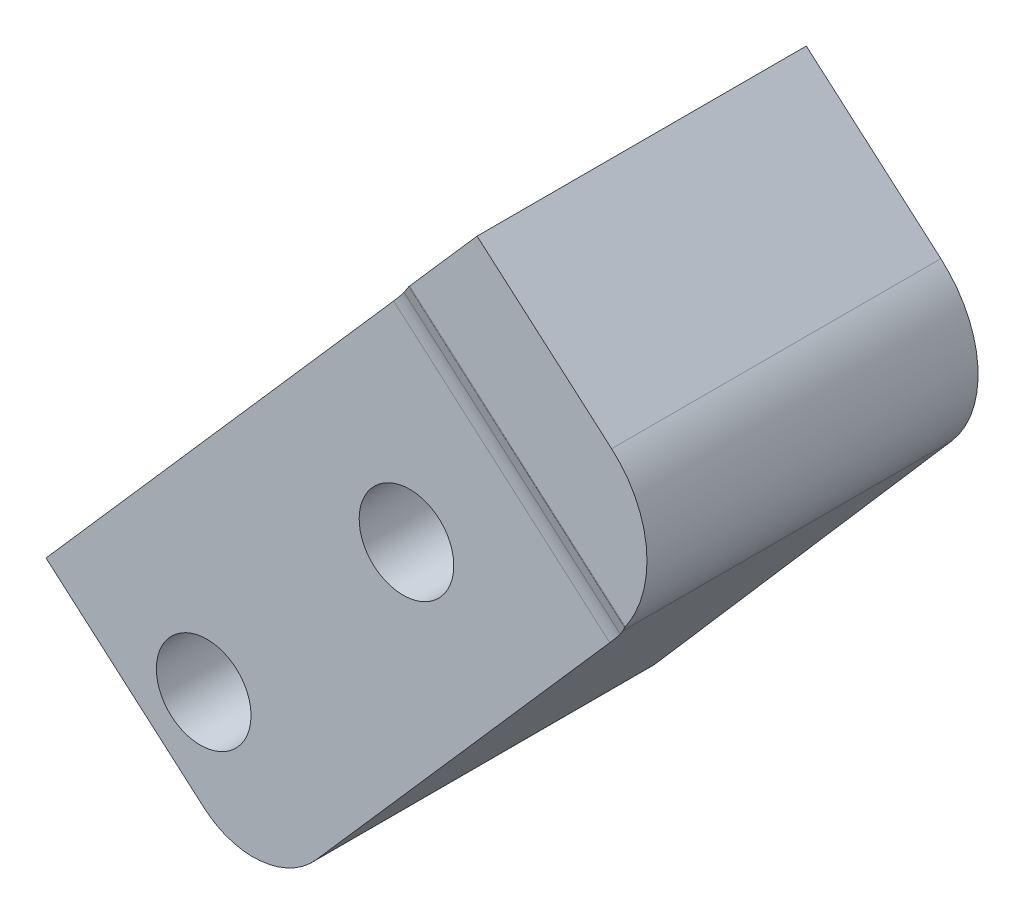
ISO-10303-21;
HEADER;
FILE_DESCRIPTION(('STEP AP214'),'2;1');
FILE_NAME('part.step','',(''),(''),'','','');
FILE_SCHEMA(('AUTOMOTIVE_DESIGN { 1 0 10303 214 1 1 1 1 }'));
ENDSEC;
DATA;
#1=APPLICATION_CONTEXT('core data for automotive mechanical design processes');
#2=APPLICATION_PROTOCOL_DEFINITION('international standard','automotive_design',2000,#1);
#3=PRODUCT_CONTEXT('',#1,'mechanical');
#4=PRODUCT('Part','Part','',(#3));
#5=PRODUCT_RELATED_PRODUCT_CATEGORY('part','',(#4));
#6=PRODUCT_DEFINITION_FORMATION('','',#4);
#7=PRODUCT_DEFINITION_CONTEXT('part definition',#1,'design');
#8=PRODUCT_DEFINITION('design','',#6,#7);
#9=PRODUCT_DEFINITION_SHAPE('','',#8);
#10=(LENGTH_UNIT() NAMED_UNIT(*) SI_UNIT(.MILLI.,.METRE.));
#11=(NAMED_UNIT(*) PLANE_ANGLE_UNIT() SI_UNIT($,.RADIAN.));
#12=(NAMED_UNIT(*) SI_UNIT($,.STERADIAN.) SOLID_ANGLE_UNIT());
#13=UNCERTAINTY_MEASURE_WITH_UNIT(LENGTH_MEASURE(1.E-05),#10,'distance_accuracy_value','');
#14=(GEOMETRIC_REPRESENTATION_CONTEXT(3) GLOBAL_UNCERTAINTY_ASSIGNED_CONTEXT((#13)) GLOBAL_UNIT_ASSIGNED_CONTEXT((#10,
#11,#12)) REPRESENTATION_CONTEXT('',''));
#15=CARTESIAN_POINT('',(0.,0.,0.));
#16=DIRECTION('',(0.,0.,1.));
#17=DIRECTION('',(1.,0.,0.));
#18=AXIS2_PLACEMENT_3D('',#15,#16,#17);
#19=CARTESIAN_POINT('',(-628.695624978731,-74.2116467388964,3.175));
#20=DIRECTION('',(0.,0.,-1.));
#21=DIRECTION('',(-1.,0.,0.));
#22=AXIS2_PLACEMENT_3D('',#19,#20,#21);
#23=CYLINDRICAL_SURFACE('',#22,10.795);
#24=DIRECTION('',(0.,0.,-1.));
#25=VECTOR('',#24,1.);
#26=CARTESIAN_POINT('',(-621.617450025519,-66.0610967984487,3.175));
#27=LINE('',#26,#25);
#28=CARTESIAN_POINT('',(-621.617450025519,-66.0610967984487,1.10115157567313));
#29=VERTEX_POINT('',#28);
#30=CARTESIAN_POINT('',(-621.617450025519,-66.0610967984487,-31.75));
#31=VERTEX_POINT('',#30);
#32=EDGE_CURVE('E247',#29,#31,#27,.T.);
#33=ORIENTED_EDGE('',*,*,#32,.F.);
#34=CARTESIAN_POINT('',(-628.695624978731,-74.2116467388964,1.66689355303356));
#35=DIRECTION('',(-0.0343161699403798,-0.0395152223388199,-0.998629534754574));
#36=DIRECTION('',(0.654791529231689,0.753995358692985,-0.0523359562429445));
#37=AXIS2_PLACEMENT_3D('',#34,#35,#36);
#38=ELLIPSE('',#37,10.8098144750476,10.795);
#39=CARTESIAN_POINT('',(-619.758730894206,-80.2667230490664,1.59938875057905));
#40=VERTEX_POINT('',#39);
#41=EDGE_CURVE('E350',#29,#40,#38,.T.);
#42=ORIENTED_EDGE('',*,*,#41,.T.);
#43=CARTESIAN_POINT('',(-619.758730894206,-80.2667230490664,1.59938875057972));
#44=CARTESIAN_POINT('',(-619.769824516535,-80.283100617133,1.60043942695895));
#45=CARTESIAN_POINT('',(-619.781024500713,-80.2995301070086,1.59977123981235));
#46=CARTESIAN_POINT('',(-619.803062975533,-80.3316733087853,1.59514276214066));
#47=CARTESIAN_POINT('',(-619.813904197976,-80.3473947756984,1.59124925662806));
#48=CARTESIAN_POINT('',(-619.829345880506,-80.3696653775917,1.58331824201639));
#49=CARTESIAN_POINT('',(-619.834128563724,-80.3765453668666,1.58051480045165));
#50=CARTESIAN_POINT('',(-619.843618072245,-80.3901633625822,1.57425024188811));
#51=CARTESIAN_POINT('',(-619.848323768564,-80.3968994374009,1.57078321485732));
#52=CARTESIAN_POINT('',(-619.852955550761,-80.4035141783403,1.56700456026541));
#53=B_SPLINE_CURVE_WITH_KNOTS('',3,(#43,#44,#45,#46,#47,#48,#49,#50,#51,#52),.UNSPECIFIED.,.F.,
.F.,(4,2,2,2,4),(0.,0.0593822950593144,0.117564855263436,0.144049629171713,0.170782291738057),.UNSPECIFIED.);
#54=CARTESIAN_POINT('',(-619.852955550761,-80.4035141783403,1.56700456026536));
#55=VERTEX_POINT('',#54);
#56=EDGE_CURVE('E168',#40,#55,#53,.T.);
#57=ORIENTED_EDGE('',*,*,#56,.T.);
#58=CARTESIAN_POINT('',(-628.695624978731,-74.2116467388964,1.03855862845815));
#59=DIRECTION('',(0.279179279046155,0.321476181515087,-0.90482705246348));
#60=DIRECTION('',(-0.593286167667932,-0.683171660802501,-0.42577929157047));
#61=AXIS2_PLACEMENT_3D('',#58,#59,#60);
#62=ELLIPSE('',#61,11.9304567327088,10.795);
#63=CARTESIAN_POINT('',(-620.545075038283,-81.2898216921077,1.03855862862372));
#64=VERTEX_POINT('',#63);
#65=EDGE_CURVE('E142',#55,#64,#62,.T.);
#66=ORIENTED_EDGE('',*,*,#65,.T.);
#67=DIRECTION('',(0.,0.,-1.));
#68=VECTOR('',#67,1.);
#69=CARTESIAN_POINT('',(-620.545075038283,-81.2898216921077,3.175));
#70=LINE('',#69,#68);
#71=CARTESIAN_POINT('',(-620.545075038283,-81.2898216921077,-31.75));
#72=VERTEX_POINT('',#71);
#73=EDGE_CURVE('E74',#64,#72,#70,.T.);
#74=ORIENTED_EDGE('',*,*,#73,.T.);
#75=CARTESIAN_POINT('',(-628.695624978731,-74.2116467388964,-31.75));
#76=DIRECTION('',(0.,0.,1.));
#77=DIRECTION('',(-1.,0.,0.));
#78=AXIS2_PLACEMENT_3D('',#75,#76,#77);
#79=CIRCLE('',#78,10.795);
#80=EDGE_CURVE('E319',#72,#31,#79,.T.);
#81=ORIENTED_EDGE('',*,*,#80,.T.);
#82=EDGE_LOOP('',(#33,#42,#57,#66,#74,#81));
#83=FACE_BOUND('',#82,.T.);
#84=ADVANCED_FACE('F50',(#83),#23,.T.);
#85=CARTESIAN_POINT('',(-635.041885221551,-54.4029262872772,3.175));
#86=DIRECTION('',(-0.65569012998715,-0.755030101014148,0.));
#87=DIRECTION('',(0.755030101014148,-0.65569012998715,0.));
#88=AXIS2_PLACEMENT_3D('',#85,#86,#87);
#89=PLANE('',#88);
#90=DIRECTION('',(0.,0.,-1.));
#91=VECTOR('',#90,1.);
#92=CARTESIAN_POINT('',(-635.041885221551,-54.4029262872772,3.175));
#93=LINE('',#92,#91);
#94=CARTESIAN_POINT('',(-635.041885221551,-54.4029262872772,1.10115157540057));
#95=VERTEX_POINT('',#94);
#96=CARTESIAN_POINT('',(-635.041885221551,-54.4029262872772,-31.75));
#97=VERTEX_POINT('',#96);
#98=EDGE_CURVE('E241',#95,#97,#93,.T.);
#99=ORIENTED_EDGE('',*,*,#98,.F.);
#100=DIRECTION('',(0.755030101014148,-0.65569012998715,1.53293565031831E-11));
#101=VECTOR('',#100,1.);
#102=CARTESIAN_POINT('',(-635.041885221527,-54.402926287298,1.10115157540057));
#103=LINE('',#102,#101);
#104=EDGE_CURVE('E177',#95,#29,#103,.T.);
#105=ORIENTED_EDGE('',*,*,#104,.T.);
#106=ORIENTED_EDGE('',*,*,#32,.T.);
#107=DIRECTION('',(-0.755030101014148,0.65569012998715,0.));
#108=VECTOR('',#107,1.);
#109=CARTESIAN_POINT('',(-635.041885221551,-54.4029262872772,-31.75));
#110=LINE('',#109,#108);
#111=EDGE_CURVE('E244',#31,#97,#110,.T.);
#112=ORIENTED_EDGE('',*,*,#111,.T.);
#113=EDGE_LOOP('',(#99,#105,#106,#112));
#114=FACE_BOUND('',#113,.T.);
#115=ADVANCED_FACE('F232',(#114),#89,.F.);
#116=CARTESIAN_POINT('',(-635.041885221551,-54.4029262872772,3.175));
#117=DIRECTION('',(0.755030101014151,-0.655690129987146,0.));
#118=DIRECTION('',(0.655690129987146,0.755030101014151,0.));
#119=AXIS2_PLACEMENT_3D('',#116,#117,#118);
#120=PLANE('',#119);
#121=CARTESIAN_POINT('',(-641.287333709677,-61.5945879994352,1.25462379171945));
#122=DIRECTION('',(0.755030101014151,-0.655690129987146,0.));
#123=DIRECTION('',(0.655690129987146,0.755030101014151,0.));
#124=AXIS2_PLACEMENT_3D('',#121,#122,#123);
#125=CIRCLE('',#124,0.345238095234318);
#126=CARTESIAN_POINT('',(-641.383717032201,-61.7055738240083,1.56700455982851));
#127=VERTEX_POINT('',#126);
#128=CARTESIAN_POINT('',(-641.275486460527,-61.5809458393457,1.59938875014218));
#129=VERTEX_POINT('',#128);
#130=EDGE_CURVE('E59',#127,#129,#125,.F.);
#131=ORIENTED_EDGE('',*,*,#130,.T.);
#132=DIRECTION('',(0.65479152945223,0.75399535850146,-0.0523359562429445));
#133=VECTOR('',#132,1.);
#134=CARTESIAN_POINT('',(-635.112954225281,-54.4847625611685,1.10683195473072));
#135=LINE('',#134,#133);
#136=EDGE_CURVE('E12',#129,#95,#135,.T.);
#137=ORIENTED_EDGE('',*,*,#136,.T.);
#138=ORIENTED_EDGE('',*,*,#98,.T.);
#139=DIRECTION('',(-0.655690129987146,-0.755030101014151,0.));
#140=VECTOR('',#139,1.);
#141=CARTESIAN_POINT('',(-635.041885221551,-54.4029262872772,-31.75));
#142=LINE('',#141,#140);
#143=CARTESIAN_POINT('',(-676.678208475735,-102.347337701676,-31.75));
#144=VERTEX_POINT('',#143);
#145=EDGE_CURVE('E314',#97,#144,#142,.T.);
#146=ORIENTED_EDGE('',*,*,#145,.T.);
#147=DIRECTION('',(0.,0.,-1.));
#148=VECTOR('',#147,1.);
#149=CARTESIAN_POINT('',(-676.678208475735,-102.347337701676,3.175));
#150=LINE('',#149,#148);
#151=CARTESIAN_POINT('',(-676.678208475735,-102.347337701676,2.47745208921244));
#152=VERTEX_POINT('',#151);
#153=EDGE_CURVE('E154',#152,#144,#150,.T.);
#154=ORIENTED_EDGE('',*,*,#153,.F.);
#155=DIRECTION('',(0.65479152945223,0.75399535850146,-0.0523359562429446));
#156=VECTOR('',#155,1.);
#157=CARTESIAN_POINT('',(-635.179833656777,-54.5617745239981,-0.839415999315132));
#158=LINE('',#157,#156);
#159=CARTESIAN_POINT('',(-644.560810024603,-65.3640105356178,-0.0896164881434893));
#160=VERTEX_POINT('',#159);
#161=EDGE_CURVE('E143',#152,#160,#158,.T.);
#162=ORIENTED_EDGE('',*,*,#161,.T.);
#163=CARTESIAN_POINT('',(-644.397717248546,-65.176208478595,4.65652107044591));
#164=DIRECTION('',(0.755030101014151,-0.655690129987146,0.));
#165=DIRECTION('',(0.655690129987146,0.755030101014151,0.));
#166=AXIS2_PLACEMENT_3D('',#163,#164,#165);
#167=CIRCLE('',#166,4.75265090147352);
#168=CARTESIAN_POINT('',(-643.070875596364,-63.6483444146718,0.356193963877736));
#169=VERTEX_POINT('',#168);
#170=EDGE_CURVE('E131',#160,#169,#167,.T.);
#171=ORIENTED_EDGE('',*,*,#170,.T.);
#172=DIRECTION('',(0.593286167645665,0.683171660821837,0.42577929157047));
#173=VECTOR('',#172,1.);
#174=CARTESIAN_POINT('',(-635.785389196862,-55.2590744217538,5.58471505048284));
#175=LINE('',#174,#173);
#176=EDGE_CURVE('E165',#169,#127,#175,.T.);
#177=ORIENTED_EDGE('',*,*,#176,.T.);
#178=EDGE_LOOP('',(#131,#137,#138,#146,#154,#162,#171,#177));
#179=FACE_BOUND('',#178,.T.);
#180=ADVANCED_FACE('F152',(#179),#120,.F.);
#181=CARTESIAN_POINT('',(-676.678208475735,-102.347337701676,3.175));
#182=DIRECTION('',(0.655690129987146,0.755030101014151,0.));
#183=DIRECTION('',(-0.755030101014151,0.655690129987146,0.));
#184=AXIS2_PLACEMENT_3D('',#181,#182,#183);
#185=PLANE('',#184);
#186=DIRECTION('',(0.,0.,-1.));
#187=VECTOR('',#186,1.);
#188=CARTESIAN_POINT('',(-660.856552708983,-116.087324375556,3.175));
#189=LINE('',#188,#187);
#190=CARTESIAN_POINT('',(-660.856552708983,-116.087324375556,2.47745208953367));
#191=VERTEX_POINT('',#190);
#192=CARTESIAN_POINT('',(-660.856552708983,-116.087324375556,-31.75));
#193=VERTEX_POINT('',#192);
#194=EDGE_CURVE('E254',#191,#193,#189,.T.);
#195=ORIENTED_EDGE('',*,*,#194,.F.);
#196=DIRECTION('',(-0.755030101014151,0.655690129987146,-1.53290851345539E-11));
#197=VECTOR('',#196,1.);
#198=CARTESIAN_POINT('',(-676.678208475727,-102.347337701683,2.47745208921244));
#199=LINE('',#198,#197);
#200=EDGE_CURVE('E156',#191,#152,#199,.T.);
#201=ORIENTED_EDGE('',*,*,#200,.T.);
#202=ORIENTED_EDGE('',*,*,#153,.T.);
#203=DIRECTION('',(0.755030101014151,-0.655690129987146,0.));
#204=VECTOR('',#203,1.);
#205=CARTESIAN_POINT('',(-676.678208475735,-102.347337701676,-31.75));
#206=LINE('',#205,#204);
#207=EDGE_CURVE('E297',#144,#193,#206,.T.);
#208=ORIENTED_EDGE('',*,*,#207,.T.);
#209=EDGE_LOOP('',(#195,#201,#202,#208));
#210=FACE_BOUND('',#209,.T.);
#211=ADVANCED_FACE('F226',(#210),#185,.F.);
#212=CARTESIAN_POINT('',(-655.860193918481,-110.333995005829,3.175));
#213=DIRECTION('',(0.,0.,-1.));
#214=DIRECTION('',(-1.,0.,0.));
#215=AXIS2_PLACEMENT_3D('',#212,#213,#214);
#216=CYLINDRICAL_SURFACE('',#215,7.62);
#217=DIRECTION('',(0.,0.,-1.));
#218=VECTOR('',#217,1.);
#219=CARTESIAN_POINT('',(-650.106864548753,-115.330353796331,3.175));
#220=LINE('',#219,#218);
#221=CARTESIAN_POINT('',(-650.106864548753,-115.330353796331,2.07810481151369));
#222=VERTEX_POINT('',#221);
#223=CARTESIAN_POINT('',(-650.106864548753,-115.330353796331,-31.75));
#224=VERTEX_POINT('',#223);
#225=EDGE_CURVE('E295',#222,#224,#220,.T.);
#226=ORIENTED_EDGE('',*,*,#225,.F.);
#227=CARTESIAN_POINT('',(-655.860193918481,-110.333995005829,2.07810481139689));
#228=DIRECTION('',(-0.0343161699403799,-0.03951522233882,-0.998629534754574));
#229=DIRECTION('',(0.654791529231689,0.753995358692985,-0.0523359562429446));
#230=AXIS2_PLACEMENT_3D('',#227,#228,#229);
#231=ELLIPSE('',#230,7.63045727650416,7.62);
#232=EDGE_CURVE('E66',#222,#191,#231,.T.);
#233=ORIENTED_EDGE('',*,*,#232,.T.);
#234=ORIENTED_EDGE('',*,*,#194,.T.);
#235=CARTESIAN_POINT('',(-655.860193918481,-110.333995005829,-31.75));
#236=DIRECTION('',(0.,0.,1.));
#237=DIRECTION('',(-1.,0.,0.));
#238=AXIS2_PLACEMENT_3D('',#235,#236,#237);
#239=CIRCLE('',#238,7.62);
#240=EDGE_CURVE('E309',#193,#224,#239,.T.);
#241=ORIENTED_EDGE('',*,*,#240,.T.);
#242=EDGE_LOOP('',(#226,#233,#234,#241));
#243=FACE_BOUND('',#242,.T.);
#244=ADVANCED_FACE('F222',(#243),#216,.T.);
#245=CARTESIAN_POINT('',(-620.545075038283,-81.2898216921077,3.175));
#246=DIRECTION('',(-0.755030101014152,0.655690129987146,0.));
#247=DIRECTION('',(-0.655690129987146,-0.755030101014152,0.));
#248=AXIS2_PLACEMENT_3D('',#245,#246,#247);
#249=PLANE('',#248);
#250=ORIENTED_EDGE('',*,*,#73,.F.);
#251=DIRECTION('',(-0.593286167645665,-0.683171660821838,-0.42577929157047));
#252=VECTOR('',#251,1.);
#253=CARTESIAN_POINT('',(-620.005390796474,-80.6683728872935,1.42586982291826));
#254=LINE('',#253,#252);
#255=CARTESIAN_POINT('',(-621.495890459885,-82.3846898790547,0.356193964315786));
#256=VERTEX_POINT('',#255);
#257=EDGE_CURVE('E266',#64,#256,#254,.T.);
#258=ORIENTED_EDGE('',*,*,#257,.T.);
#259=CARTESIAN_POINT('',(-622.822732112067,-83.912553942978,4.65652107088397));
#260=DIRECTION('',(-0.755030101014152,0.655690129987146,0.));
#261=DIRECTION('',(-0.655690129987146,-0.755030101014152,0.));
#262=AXIS2_PLACEMENT_3D('',#259,#260,#261);
#263=CIRCLE('',#262,4.75265090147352);
#264=CARTESIAN_POINT('',(-622.985824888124,-84.1003560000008,-0.0896164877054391));
#265=VERTEX_POINT('',#264);
#266=EDGE_CURVE('E252',#256,#265,#263,.T.);
#267=ORIENTED_EDGE('',*,*,#266,.T.);
#268=DIRECTION('',(-0.65479152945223,-0.753995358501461,0.0523359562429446));
#269=VECTOR('',#268,1.);
#270=CARTESIAN_POINT('',(-620.663635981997,-81.4263451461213,-0.275223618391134));
#271=LINE('',#270,#269);
#272=EDGE_CURVE('E147',#265,#222,#271,.T.);
#273=ORIENTED_EDGE('',*,*,#272,.T.);
#274=ORIENTED_EDGE('',*,*,#225,.T.);
#275=DIRECTION('',(0.655690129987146,0.755030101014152,0.));
#276=VECTOR('',#275,1.);
#277=CARTESIAN_POINT('',(-620.545075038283,-81.2898216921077,-31.75));
#278=LINE('',#277,#276);
#279=EDGE_CURVE('E306',#224,#72,#278,.T.);
#280=ORIENTED_EDGE('',*,*,#279,.T.);
#281=EDGE_LOOP('',(#250,#258,#267,#273,#274,#280));
#282=FACE_BOUND('',#281,.T.);
#283=ADVANCED_FACE('F218',(#282),#249,.F.);
#284=CARTESIAN_POINT('',(-628.695624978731,-74.2116467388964,-31.75));
#285=DIRECTION('',(0.,0.,-1.));
#286=DIRECTION('',(-1.,0.,0.));
#287=AXIS2_PLACEMENT_3D('',#284,#285,#286);
#288=PLANE('',#287);
#289=CARTESIAN_POINT('',(-661.310720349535,-106.441625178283,-31.75));
#290=DIRECTION('',(0.,0.,1.));
#291=DIRECTION('',(1.,0.,0.));
#292=AXIS2_PLACEMENT_3D('',#289,#290,#291);
#293=CIRCLE('',#292,2.80669999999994);
#294=CARTESIAN_POINT('',(-658.504020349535,-106.441625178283,-31.75));
#295=VERTEX_POINT('',#294);
#296=EDGE_CURVE('E346',#295,#295,#293,.T.);
#297=ORIENTED_EDGE('',*,*,#296,.T.);
#298=EDGE_LOOP('',(#297));
#299=FACE_BOUND('',#298,.T.);
#300=CARTESIAN_POINT('',(-642.574374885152,-84.8666400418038,-31.75));
#301=DIRECTION('',(0.,0.,1.));
#302=DIRECTION('',(1.,0.,0.));
#303=AXIS2_PLACEMENT_3D('',#300,#301,#302);
#304=CIRCLE('',#303,2.80669999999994);
#305=CARTESIAN_POINT('',(-639.767674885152,-84.8666400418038,-31.75));
#306=VERTEX_POINT('',#305);
#307=EDGE_CURVE('E334',#306,#306,#304,.T.);
#308=ORIENTED_EDGE('',*,*,#307,.T.);
#309=EDGE_LOOP('',(#308));
#310=FACE_BOUND('',#309,.T.);
#311=ORIENTED_EDGE('',*,*,#80,.F.);
#312=ORIENTED_EDGE('',*,*,#279,.F.);
#313=ORIENTED_EDGE('',*,*,#240,.F.);
#314=ORIENTED_EDGE('',*,*,#207,.F.);
#315=ORIENTED_EDGE('',*,*,#145,.F.);
#316=ORIENTED_EDGE('',*,*,#111,.F.);
#317=EDGE_LOOP('',(#311,#312,#313,#314,#315,#316));
#318=FACE_BOUND('',#317,.T.);
#319=ADVANCED_FACE('F214',(#299,#310,#318),#288,.T.);
#320=CARTESIAN_POINT('',(-642.574374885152,-84.8666400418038,3.175));
#321=DIRECTION('',(0.,0.,1.));
#322=DIRECTION('',(1.,0.,0.));
#323=AXIS2_PLACEMENT_3D('',#320,#321,#322);
#324=CYLINDRICAL_SURFACE('',#323,4.55930000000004);
#325=CARTESIAN_POINT('',(-642.574374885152,-84.8666400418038,0.613831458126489));
#326=DIRECTION('',(-0.0343161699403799,-0.03951522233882,-0.998629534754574));
#327=DIRECTION('',(-0.654791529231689,-0.753995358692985,0.0523359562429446));
#328=AXIS2_PLACEMENT_3D('',#325,#326,#327);
#329=ELLIPSE('',#328,4.56555693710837,4.55930000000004);
#330=CARTESIAN_POINT('',(-645.563862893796,-88.3090487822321,0.852774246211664));
#331=VERTEX_POINT('',#330);
#332=EDGE_CURVE('E262',#331,#331,#329,.F.);
#333=ORIENTED_EDGE('',*,*,#332,.T.);
#334=EDGE_LOOP('',(#333));
#335=FACE_BOUND('',#334,.T.);
#336=CARTESIAN_POINT('',(-642.574374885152,-84.8666400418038,-8.763));
#337=DIRECTION('',(0.,0.,1.));
#338=DIRECTION('',(1.,0.,0.));
#339=AXIS2_PLACEMENT_3D('',#336,#337,#338);
#340=CIRCLE('',#339,4.55930000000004);
#341=CARTESIAN_POINT('',(-638.015074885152,-84.8666400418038,-8.763));
#342=VERTEX_POINT('',#341);
#343=EDGE_CURVE('E322',#342,#342,#340,.T.);
#344=ORIENTED_EDGE('',*,*,#343,.F.);
#345=EDGE_LOOP('',(#344));
#346=FACE_BOUND('',#345,.T.);
#347=ADVANCED_FACE('F210',(#335,#346),#324,.F.);
#348=CARTESIAN_POINT('',(-639.767674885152,-84.8666400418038,-8.763));
#349=DIRECTION('',(0.,0.,-1.));
#350=DIRECTION('',(-1.,0.,0.));
#351=AXIS2_PLACEMENT_3D('',#348,#349,#350);
#352=PLANE('',#351);
#353=CARTESIAN_POINT('',(-642.574374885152,-84.8666400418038,-8.763));
#354=DIRECTION('',(0.,0.,1.));
#355=DIRECTION('',(1.,0.,0.));
#356=AXIS2_PLACEMENT_3D('',#353,#354,#355);
#357=CIRCLE('',#356,2.80670000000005);
#358=CARTESIAN_POINT('',(-639.767674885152,-84.8666400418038,-8.763));
#359=VERTEX_POINT('',#358);
#360=EDGE_CURVE('E327',#359,#359,#357,.T.);
#361=ORIENTED_EDGE('',*,*,#360,.F.);
#362=EDGE_LOOP('',(#361));
#363=FACE_BOUND('',#362,.T.);
#364=ORIENTED_EDGE('',*,*,#343,.T.);
#365=EDGE_LOOP('',(#364));
#366=FACE_BOUND('',#365,.T.);
#367=ADVANCED_FACE('F206',(#363,#366),#352,.F.);
#368=CARTESIAN_POINT('',(-642.574374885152,-84.8666400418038,3.175));
#369=DIRECTION('',(0.,0.,1.));
#370=DIRECTION('',(1.,0.,0.));
#371=AXIS2_PLACEMENT_3D('',#368,#369,#370);
#372=CYLINDRICAL_SURFACE('',#371,2.8067);
#373=ORIENTED_EDGE('',*,*,#307,.F.);
#374=EDGE_LOOP('',(#373));
#375=FACE_BOUND('',#374,.T.);
#376=ORIENTED_EDGE('',*,*,#360,.T.);
#377=EDGE_LOOP('',(#376));
#378=FACE_BOUND('',#377,.T.);
#379=ADVANCED_FACE('F202',(#375,#378),#372,.F.);
#380=CARTESIAN_POINT('',(-661.310720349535,-106.441625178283,3.175));
#381=DIRECTION('',(0.,0.,1.));
#382=DIRECTION('',(1.,0.,0.));
#383=AXIS2_PLACEMENT_3D('',#380,#381,#382);
#384=CYLINDRICAL_SURFACE('',#383,4.55930000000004);
#385=CARTESIAN_POINT('',(-661.310720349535,-106.441625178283,2.11138375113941));
#386=DIRECTION('',(-0.0343161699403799,-0.03951522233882,-0.998629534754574));
#387=DIRECTION('',(-0.654791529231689,-0.753995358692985,0.0523359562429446));
#388=AXIS2_PLACEMENT_3D('',#385,#386,#387);
#389=ELLIPSE('',#388,4.56555693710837,4.55930000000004);
#390=CARTESIAN_POINT('',(-664.300208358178,-109.884033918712,2.35032653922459));
#391=VERTEX_POINT('',#390);
#392=EDGE_CURVE('E258',#391,#391,#389,.F.);
#393=ORIENTED_EDGE('',*,*,#392,.T.);
#394=EDGE_LOOP('',(#393));
#395=FACE_BOUND('',#394,.T.);
#396=CARTESIAN_POINT('',(-661.310720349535,-106.441625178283,-8.763));
#397=DIRECTION('',(0.,0.,1.));
#398=DIRECTION('',(1.,0.,0.));
#399=AXIS2_PLACEMENT_3D('',#396,#397,#398);
#400=CIRCLE('',#399,4.55930000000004);
#401=CARTESIAN_POINT('',(-656.751420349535,-106.441625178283,-8.763));
#402=VERTEX_POINT('',#401);
#403=EDGE_CURVE('E339',#402,#402,#400,.T.);
#404=ORIENTED_EDGE('',*,*,#403,.F.);
#405=EDGE_LOOP('',(#404));
#406=FACE_BOUND('',#405,.T.);
#407=ADVANCED_FACE('F198',(#395,#406),#384,.F.);
#408=CARTESIAN_POINT('',(-658.504020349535,-106.441625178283,-8.763));
#409=DIRECTION('',(0.,0.,-1.));
#410=DIRECTION('',(-1.,0.,0.));
#411=AXIS2_PLACEMENT_3D('',#408,#409,#410);
#412=PLANE('',#411);
#413=CARTESIAN_POINT('',(-661.310720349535,-106.441625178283,-8.763));
#414=DIRECTION('',(0.,0.,1.));
#415=DIRECTION('',(1.,0.,0.));
#416=AXIS2_PLACEMENT_3D('',#413,#414,#415);
#417=CIRCLE('',#416,2.80670000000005);
#418=CARTESIAN_POINT('',(-658.504020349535,-106.441625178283,-8.763));
#419=VERTEX_POINT('',#418);
#420=EDGE_CURVE('E343',#419,#419,#417,.T.);
#421=ORIENTED_EDGE('',*,*,#420,.F.);
#422=EDGE_LOOP('',(#421));
#423=FACE_BOUND('',#422,.T.);
#424=ORIENTED_EDGE('',*,*,#403,.T.);
#425=EDGE_LOOP('',(#424));
#426=FACE_BOUND('',#425,.T.);
#427=ADVANCED_FACE('F194',(#423,#426),#412,.F.);
#428=CARTESIAN_POINT('',(-661.310720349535,-106.441625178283,3.175));
#429=DIRECTION('',(0.,0.,1.));
#430=DIRECTION('',(1.,0.,0.));
#431=AXIS2_PLACEMENT_3D('',#428,#429,#430);
#432=CYLINDRICAL_SURFACE('',#431,2.8067);
#433=ORIENTED_EDGE('',*,*,#296,.F.);
#434=EDGE_LOOP('',(#433));
#435=FACE_BOUND('',#434,.T.);
#436=ORIENTED_EDGE('',*,*,#420,.T.);
#437=EDGE_LOOP('',(#436));
#438=FACE_BOUND('',#437,.T.);
#439=ADVANCED_FACE('F190',(#435,#438),#432,.F.);
#440=CARTESIAN_POINT('',(-724.465409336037,10.6636060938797,1.59938874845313));
#441=DIRECTION('',(-0.0343161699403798,-0.0395152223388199,-0.998629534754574));
#442=DIRECTION('',(0.,0.999218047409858,-0.0395385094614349));
#443=AXIS2_PLACEMENT_3D('',#440,#441,#442);
#444=PLANE('',#443);
#445=ORIENTED_EDGE('',*,*,#41,.F.);
#446=ORIENTED_EDGE('',*,*,#104,.F.);
#447=ORIENTED_EDGE('',*,*,#136,.F.);
#448=DIRECTION('',(0.755030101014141,-0.655690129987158,1.53298533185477E-11));
#449=VECTOR('',#448,1.);
#450=CARTESIAN_POINT('',(-724.465409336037,10.6636060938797,1.59938874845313));
#451=LINE('',#450,#449);
#452=EDGE_CURVE('E263',#129,#40,#451,.T.);
#453=ORIENTED_EDGE('',*,*,#452,.T.);
#454=EDGE_LOOP('',(#445,#446,#447,#453));
#455=FACE_BOUND('',#454,.T.);
#456=ADVANCED_FACE('F185',(#455),#444,.F.);
#457=CARTESIAN_POINT('',(-724.477256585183,10.6499639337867,1.25462379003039));
#458=DIRECTION('',(0.755030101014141,-0.655690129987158,1.53298533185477E-11));
#459=DIRECTION('',(0.655690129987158,0.755030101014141,0.));
#460=AXIS2_PLACEMENT_3D('',#457,#458,#459);
#461=CYLINDRICAL_SURFACE('',#460,0.345238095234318);
#462=ORIENTED_EDGE('',*,*,#56,.F.);
#463=ORIENTED_EDGE('',*,*,#452,.F.);
#464=ORIENTED_EDGE('',*,*,#130,.F.);
#465=DIRECTION('',(0.755030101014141,-0.655690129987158,1.53298533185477E-11));
#466=VECTOR('',#465,1.);
#467=CARTESIAN_POINT('',(-724.57363990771,10.5389781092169,1.56700455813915));
#468=LINE('',#467,#466);
#469=EDGE_CURVE('E274',#127,#55,#468,.T.);
#470=ORIENTED_EDGE('',*,*,#469,.T.);
#471=EDGE_LOOP('',(#462,#463,#464,#470));
#472=FACE_BOUND('',#471,.T.);
#473=ADVANCED_FACE('F179',(#472),#461,.T.);
#474=CARTESIAN_POINT('',(-726.26079847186,8.59620751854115,0.356193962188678));
#475=DIRECTION('',(0.279179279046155,0.321476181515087,-0.90482705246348));
#476=DIRECTION('',(0.,0.942293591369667,0.334787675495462));
#477=AXIS2_PLACEMENT_3D('',#474,#475,#476);
#478=PLANE('',#477);
#479=ORIENTED_EDGE('',*,*,#176,.F.);
#480=DIRECTION('',(0.755030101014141,-0.655690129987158,1.53298533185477E-11));
#481=VECTOR('',#480,1.);
#482=CARTESIAN_POINT('',(-726.26079847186,8.59620751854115,0.356193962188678));
#483=LINE('',#482,#481);
#484=EDGE_CURVE('E137',#169,#256,#483,.T.);
#485=ORIENTED_EDGE('',*,*,#484,.T.);
#486=ORIENTED_EDGE('',*,*,#257,.F.);
#487=ORIENTED_EDGE('',*,*,#65,.F.);
#488=ORIENTED_EDGE('',*,*,#469,.F.);
#489=EDGE_LOOP('',(#479,#485,#486,#487,#488));
#490=FACE_BOUND('',#489,.T.);
#491=ADVANCED_FACE('F184',(#490),#478,.F.);
#492=CARTESIAN_POINT('',(-727.587640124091,7.0683434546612,4.65652106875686));
#493=DIRECTION('',(0.755030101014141,-0.655690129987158,1.53298533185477E-11));
#494=DIRECTION('',(0.655690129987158,0.755030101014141,0.));
#495=AXIS2_PLACEMENT_3D('',#492,#493,#494);
#496=CYLINDRICAL_SURFACE('',#495,4.75265090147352);
#497=ORIENTED_EDGE('',*,*,#170,.F.);
#498=DIRECTION('',(0.755030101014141,-0.655690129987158,1.53298533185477E-11));
#499=VECTOR('',#498,1.);
#500=CARTESIAN_POINT('',(-727.750732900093,6.8805413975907,-0.0896164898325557));
#501=LINE('',#500,#499);
#502=EDGE_CURVE('E134',#160,#265,#501,.T.);
#503=ORIENTED_EDGE('',*,*,#502,.T.);
#504=ORIENTED_EDGE('',*,*,#266,.F.);
#505=ORIENTED_EDGE('',*,*,#484,.F.);
#506=EDGE_LOOP('',(#497,#503,#504,#505));
#507=FACE_BOUND('',#506,.T.);
#508=ADVANCED_FACE('F133',(#507),#496,.F.);
#509=CARTESIAN_POINT('',(-727.750732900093,6.88054139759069,-0.0896164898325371));
#510=DIRECTION('',(-0.0343161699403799,-0.03951522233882,-0.998629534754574));
#511=DIRECTION('',(0.,0.999218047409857,-0.039538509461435));
#512=AXIS2_PLACEMENT_3D('',#509,#510,#511);
#513=PLANE('',#512);
#514=ORIENTED_EDGE('',*,*,#332,.F.);
#515=EDGE_LOOP('',(#514));
#516=FACE_BOUND('',#515,.T.);
#517=ORIENTED_EDGE('',*,*,#392,.F.);
#518=EDGE_LOOP('',(#517));
#519=FACE_BOUND('',#518,.T.);
#520=ORIENTED_EDGE('',*,*,#161,.F.);
#521=ORIENTED_EDGE('',*,*,#200,.F.);
#522=ORIENTED_EDGE('',*,*,#232,.F.);
#523=ORIENTED_EDGE('',*,*,#272,.F.);
#524=ORIENTED_EDGE('',*,*,#502,.F.);
#525=EDGE_LOOP('',(#520,#521,#522,#523,#524));
#526=FACE_BOUND('',#525,.T.);
#527=ADVANCED_FACE('F145',(#516,#519,#526),#513,.F.);
#528=CLOSED_SHELL('',(#84,#115,#180,#211,#244,#283,#319,#347,#367,#379,#407,#427,#439,#456,#473,
#491,#508,#527));
#529=MANIFOLD_SOLID_BREP('B2',#528);
#530=ADVANCED_BREP_SHAPE_REPRESENTATION('',(#18,#529),#14);
#531=SHAPE_DEFINITION_REPRESENTATION(#9,#530);
ENDSEC;
END-ISO-10303-21;
